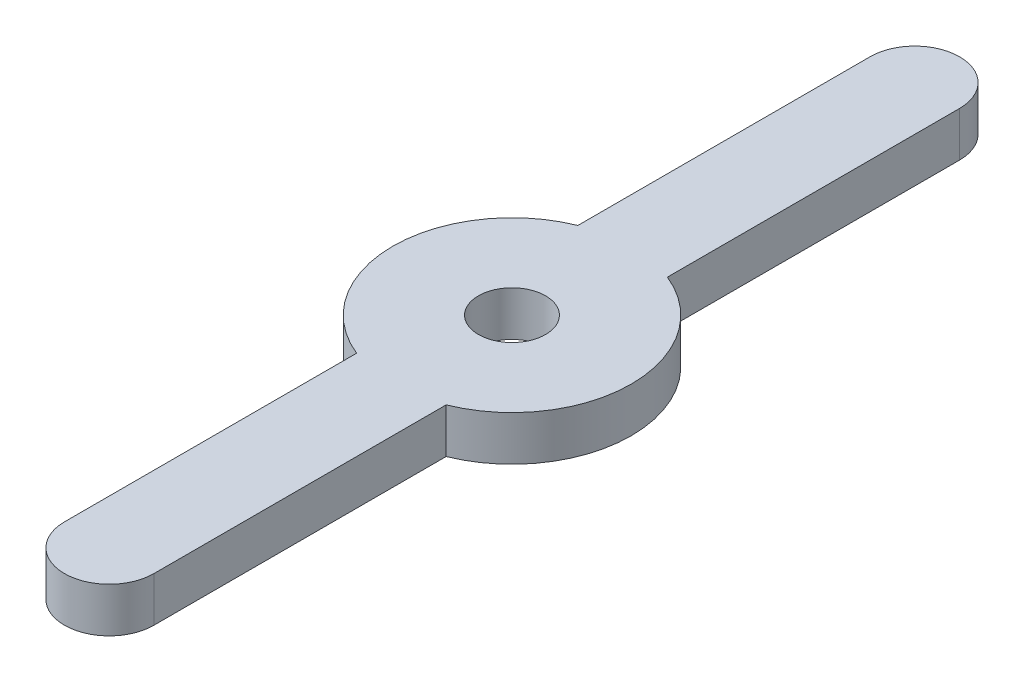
ISO-10303-21;
HEADER;
FILE_DESCRIPTION(('STEP AP214'),'2;1');
FILE_NAME('part.step','',(''),(''),'','','');
FILE_SCHEMA(('AUTOMOTIVE_DESIGN { 1 0 10303 214 1 1 1 1 }'));
ENDSEC;
DATA;
#1=APPLICATION_CONTEXT('core data for automotive mechanical design processes');
#2=APPLICATION_PROTOCOL_DEFINITION('international standard','automotive_design',2000,#1);
#3=PRODUCT_CONTEXT('',#1,'mechanical');
#4=PRODUCT('Part','Part','',(#3));
#5=PRODUCT_RELATED_PRODUCT_CATEGORY('part','',(#4));
#6=PRODUCT_DEFINITION_FORMATION('','',#4);
#7=PRODUCT_DEFINITION_CONTEXT('part definition',#1,'design');
#8=PRODUCT_DEFINITION('design','',#6,#7);
#9=PRODUCT_DEFINITION_SHAPE('','',#8);
#10=(LENGTH_UNIT() NAMED_UNIT(*) SI_UNIT(.MILLI.,.METRE.));
#11=(NAMED_UNIT(*) PLANE_ANGLE_UNIT() SI_UNIT($,.RADIAN.));
#12=(NAMED_UNIT(*) SI_UNIT($,.STERADIAN.) SOLID_ANGLE_UNIT());
#13=UNCERTAINTY_MEASURE_WITH_UNIT(LENGTH_MEASURE(1.E-05),#10,'distance_accuracy_value','');
#14=(GEOMETRIC_REPRESENTATION_CONTEXT(3) GLOBAL_UNCERTAINTY_ASSIGNED_CONTEXT((#13)) GLOBAL_UNIT_ASSIGNED_CONTEXT((#10,
#11,#12)) REPRESENTATION_CONTEXT('',''));
#15=CARTESIAN_POINT('',(0.,0.,0.));
#16=DIRECTION('',(0.,0.,1.));
#17=DIRECTION('',(1.,0.,0.));
#18=AXIS2_PLACEMENT_3D('',#15,#16,#17);
#19=CARTESIAN_POINT('',(0.,3.,-27.));
#20=DIRECTION('',(0.,1.,0.));
#21=DIRECTION('',(0.,0.,1.));
#22=AXIS2_PLACEMENT_3D('',#19,#20,#21);
#23=PLANE('',#22);
#24=CARTESIAN_POINT('',(0.,3.,-27.));
#25=DIRECTION('',(0.,1.,0.));
#26=DIRECTION('',(0.,0.,1.));
#27=AXIS2_PLACEMENT_3D('',#24,#25,#26);
#28=CIRCLE('',#27,8.);
#29=CARTESIAN_POINT('',(3.,3.,-19.5838015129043));
#30=VERTEX_POINT('',#29);
#31=CARTESIAN_POINT('',(3.,3.,-34.4161984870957));
#32=VERTEX_POINT('',#31);
#33=EDGE_CURVE('E143',#30,#32,#28,.T.);
#34=ORIENTED_EDGE('',*,*,#33,.T.);
#35=DIRECTION('',(0.,0.,-1.));
#36=VECTOR('',#35,1.);
#37=CARTESIAN_POINT('',(3.,3.,-54.));
#38=LINE('',#37,#36);
#39=CARTESIAN_POINT('',(3.,3.,-54.));
#40=VERTEX_POINT('',#39);
#41=EDGE_CURVE('E91',#32,#40,#38,.T.);
#42=ORIENTED_EDGE('',*,*,#41,.T.);
#43=CARTESIAN_POINT('',(0.,3.,-54.));
#44=DIRECTION('',(0.,1.,0.));
#45=DIRECTION('',(0.,0.,1.));
#46=AXIS2_PLACEMENT_3D('',#43,#44,#45);
#47=CIRCLE('',#46,3.);
#48=CARTESIAN_POINT('',(-3.,3.,-54.));
#49=VERTEX_POINT('',#48);
#50=EDGE_CURVE('E158',#40,#49,#47,.T.);
#51=ORIENTED_EDGE('',*,*,#50,.T.);
#52=DIRECTION('',(0.,0.,1.));
#53=VECTOR('',#52,1.);
#54=CARTESIAN_POINT('',(-3.,3.,-54.));
#55=LINE('',#54,#53);
#56=CARTESIAN_POINT('',(-3.,3.,-34.4161984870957));
#57=VERTEX_POINT('',#56);
#58=EDGE_CURVE('E171',#49,#57,#55,.T.);
#59=ORIENTED_EDGE('',*,*,#58,.T.);
#60=CARTESIAN_POINT('',(0.,3.,-27.));
#61=DIRECTION('',(0.,1.,0.));
#62=DIRECTION('',(0.,0.,1.));
#63=AXIS2_PLACEMENT_3D('',#60,#61,#62);
#64=CIRCLE('',#63,8.);
#65=CARTESIAN_POINT('',(-3.,3.,-19.5838015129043));
#66=VERTEX_POINT('',#65);
#67=EDGE_CURVE('E110',#57,#66,#64,.T.);
#68=ORIENTED_EDGE('',*,*,#67,.T.);
#69=DIRECTION('',(0.,0.,1.));
#70=VECTOR('',#69,1.);
#71=CARTESIAN_POINT('',(-3.,3.,-19.5838015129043));
#72=LINE('',#71,#70);
#73=CARTESIAN_POINT('',(-3.,3.,0.));
#74=VERTEX_POINT('',#73);
#75=EDGE_CURVE('E104',#66,#74,#72,.T.);
#76=ORIENTED_EDGE('',*,*,#75,.T.);
#77=CARTESIAN_POINT('',(0.,3.,0.));
#78=DIRECTION('',(0.,1.,0.));
#79=DIRECTION('',(0.,0.,1.));
#80=AXIS2_PLACEMENT_3D('',#77,#78,#79);
#81=CIRCLE('',#80,3.);
#82=CARTESIAN_POINT('',(3.,3.,0.));
#83=VERTEX_POINT('',#82);
#84=EDGE_CURVE('E108',#74,#83,#81,.T.);
#85=ORIENTED_EDGE('',*,*,#84,.T.);
#86=DIRECTION('',(0.,0.,-1.));
#87=VECTOR('',#86,1.);
#88=CARTESIAN_POINT('',(3.,3.,-19.5838015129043));
#89=LINE('',#88,#87);
#90=EDGE_CURVE('E48',#83,#30,#89,.T.);
#91=ORIENTED_EDGE('',*,*,#90,.T.);
#92=EDGE_LOOP('',(#34,#42,#51,#59,#68,#76,#85,#91));
#93=FACE_BOUND('',#92,.T.);
#94=CARTESIAN_POINT('',(0.,3.,-27.));
#95=DIRECTION('',(0.,1.,0.));
#96=DIRECTION('',(0.,0.,1.));
#97=AXIS2_PLACEMENT_3D('',#94,#95,#96);
#98=CIRCLE('',#97,2.25);
#99=CARTESIAN_POINT('',(0.,3.,-24.75));
#100=VERTEX_POINT('',#99);
#101=EDGE_CURVE('E132',#100,#100,#98,.T.);
#102=ORIENTED_EDGE('',*,*,#101,.F.);
#103=EDGE_LOOP('',(#102));
#104=FACE_BOUND('',#103,.T.);
#105=ADVANCED_FACE('F31',(#93,#104),#23,.T.);
#106=CARTESIAN_POINT('',(0.,0.,-27.));
#107=DIRECTION('',(0.,1.,0.));
#108=DIRECTION('',(0.,0.,1.));
#109=AXIS2_PLACEMENT_3D('',#106,#107,#108);
#110=PLANE('',#109);
#111=CARTESIAN_POINT('',(0.,0.,-27.));
#112=DIRECTION('',(0.,1.,0.));
#113=DIRECTION('',(0.,0.,1.));
#114=AXIS2_PLACEMENT_3D('',#111,#112,#113);
#115=CIRCLE('',#114,8.);
#116=CARTESIAN_POINT('',(3.,0.,-19.5838015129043));
#117=VERTEX_POINT('',#116);
#118=CARTESIAN_POINT('',(3.,0.,-34.4161984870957));
#119=VERTEX_POINT('',#118);
#120=EDGE_CURVE('E128',#117,#119,#115,.T.);
#121=ORIENTED_EDGE('',*,*,#120,.F.);
#122=DIRECTION('',(0.,0.,-1.));
#123=VECTOR('',#122,1.);
#124=CARTESIAN_POINT('',(3.,0.,-19.5838015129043));
#125=LINE('',#124,#123);
#126=CARTESIAN_POINT('',(3.,0.,0.));
#127=VERTEX_POINT('',#126);
#128=EDGE_CURVE('E83',#127,#117,#125,.T.);
#129=ORIENTED_EDGE('',*,*,#128,.F.);
#130=CARTESIAN_POINT('',(0.,0.,0.));
#131=DIRECTION('',(0.,1.,0.));
#132=DIRECTION('',(0.,0.,1.));
#133=AXIS2_PLACEMENT_3D('',#130,#131,#132);
#134=CIRCLE('',#133,3.);
#135=CARTESIAN_POINT('',(-3.,0.,0.));
#136=VERTEX_POINT('',#135);
#137=EDGE_CURVE('E77',#136,#127,#134,.T.);
#138=ORIENTED_EDGE('',*,*,#137,.F.);
#139=DIRECTION('',(0.,0.,1.));
#140=VECTOR('',#139,1.);
#141=CARTESIAN_POINT('',(-3.,0.,-19.5838015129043));
#142=LINE('',#141,#140);
#143=CARTESIAN_POINT('',(-3.,0.,-19.5838015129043));
#144=VERTEX_POINT('',#143);
#145=EDGE_CURVE('E118',#144,#136,#142,.T.);
#146=ORIENTED_EDGE('',*,*,#145,.F.);
#147=CARTESIAN_POINT('',(0.,0.,-27.));
#148=DIRECTION('',(0.,1.,0.));
#149=DIRECTION('',(0.,0.,1.));
#150=AXIS2_PLACEMENT_3D('',#147,#148,#149);
#151=CIRCLE('',#150,8.);
#152=CARTESIAN_POINT('',(-3.,0.,-34.4161984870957));
#153=VERTEX_POINT('',#152);
#154=EDGE_CURVE('E138',#153,#144,#151,.T.);
#155=ORIENTED_EDGE('',*,*,#154,.F.);
#156=DIRECTION('',(0.,0.,1.));
#157=VECTOR('',#156,1.);
#158=CARTESIAN_POINT('',(-3.,0.,-54.));
#159=LINE('',#158,#157);
#160=CARTESIAN_POINT('',(-3.,0.,-54.));
#161=VERTEX_POINT('',#160);
#162=EDGE_CURVE('E136',#161,#153,#159,.T.);
#163=ORIENTED_EDGE('',*,*,#162,.F.);
#164=CARTESIAN_POINT('',(0.,0.,-54.));
#165=DIRECTION('',(0.,1.,0.));
#166=DIRECTION('',(0.,0.,1.));
#167=AXIS2_PLACEMENT_3D('',#164,#165,#166);
#168=CIRCLE('',#167,3.);
#169=CARTESIAN_POINT('',(3.,0.,-54.));
#170=VERTEX_POINT('',#169);
#171=EDGE_CURVE('E134',#170,#161,#168,.T.);
#172=ORIENTED_EDGE('',*,*,#171,.F.);
#173=DIRECTION('',(0.,0.,-1.));
#174=VECTOR('',#173,1.);
#175=CARTESIAN_POINT('',(3.,0.,-54.));
#176=LINE('',#175,#174);
#177=EDGE_CURVE('E131',#119,#170,#176,.T.);
#178=ORIENTED_EDGE('',*,*,#177,.F.);
#179=EDGE_LOOP('',(#121,#129,#138,#146,#155,#163,#172,#178));
#180=FACE_BOUND('',#179,.T.);
#181=CARTESIAN_POINT('',(0.,0.,-27.));
#182=DIRECTION('',(0.,1.,0.));
#183=DIRECTION('',(0.,0.,1.));
#184=AXIS2_PLACEMENT_3D('',#181,#182,#183);
#185=CIRCLE('',#184,2.25);
#186=CARTESIAN_POINT('',(0.,0.,-24.75));
#187=VERTEX_POINT('',#186);
#188=EDGE_CURVE('E177',#187,#187,#185,.T.);
#189=ORIENTED_EDGE('',*,*,#188,.T.);
#190=EDGE_LOOP('',(#189));
#191=FACE_BOUND('',#190,.T.);
#192=ADVANCED_FACE('F162',(#180,#191),#110,.F.);
#193=CARTESIAN_POINT('',(0.,3.,-27.));
#194=DIRECTION('',(0.,-1.,0.));
#195=DIRECTION('',(0.,0.,-1.));
#196=AXIS2_PLACEMENT_3D('',#193,#194,#195);
#197=CYLINDRICAL_SURFACE('',#196,8.);
#198=ORIENTED_EDGE('',*,*,#120,.T.);
#199=DIRECTION('',(0.,-1.,0.));
#200=VECTOR('',#199,1.);
#201=CARTESIAN_POINT('',(3.,3.,-34.4161984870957));
#202=LINE('',#201,#200);
#203=EDGE_CURVE('E11',#32,#119,#202,.T.);
#204=ORIENTED_EDGE('',*,*,#203,.F.);
#205=ORIENTED_EDGE('',*,*,#33,.F.);
#206=DIRECTION('',(0.,-1.,0.));
#207=VECTOR('',#206,1.);
#208=CARTESIAN_POINT('',(3.,3.,-19.5838015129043));
#209=LINE('',#208,#207);
#210=EDGE_CURVE('E124',#30,#117,#209,.T.);
#211=ORIENTED_EDGE('',*,*,#210,.T.);
#212=EDGE_LOOP('',(#198,#204,#205,#211));
#213=FACE_BOUND('',#212,.T.);
#214=ADVANCED_FACE('F33',(#213),#197,.T.);
#215=CARTESIAN_POINT('',(3.,3.,-54.));
#216=DIRECTION('',(-1.,0.,0.));
#217=DIRECTION('',(0.,0.,1.));
#218=AXIS2_PLACEMENT_3D('',#215,#216,#217);
#219=PLANE('',#218);
#220=ORIENTED_EDGE('',*,*,#177,.T.);
#221=DIRECTION('',(0.,-1.,0.));
#222=VECTOR('',#221,1.);
#223=CARTESIAN_POINT('',(3.,3.,-54.));
#224=LINE('',#223,#222);
#225=EDGE_CURVE('E40',#40,#170,#224,.T.);
#226=ORIENTED_EDGE('',*,*,#225,.F.);
#227=ORIENTED_EDGE('',*,*,#41,.F.);
#228=ORIENTED_EDGE('',*,*,#203,.T.);
#229=EDGE_LOOP('',(#220,#226,#227,#228));
#230=FACE_BOUND('',#229,.T.);
#231=ADVANCED_FACE('F205',(#230),#219,.F.);
#232=CARTESIAN_POINT('',(0.,3.,-54.));
#233=DIRECTION('',(0.,-1.,0.));
#234=DIRECTION('',(0.,0.,-1.));
#235=AXIS2_PLACEMENT_3D('',#232,#233,#234);
#236=CYLINDRICAL_SURFACE('',#235,3.);
#237=ORIENTED_EDGE('',*,*,#171,.T.);
#238=DIRECTION('',(0.,-1.,0.));
#239=VECTOR('',#238,1.);
#240=CARTESIAN_POINT('',(-3.,3.,-54.));
#241=LINE('',#240,#239);
#242=EDGE_CURVE('E150',#49,#161,#241,.T.);
#243=ORIENTED_EDGE('',*,*,#242,.F.);
#244=ORIENTED_EDGE('',*,*,#50,.F.);
#245=ORIENTED_EDGE('',*,*,#225,.T.);
#246=EDGE_LOOP('',(#237,#243,#244,#245));
#247=FACE_BOUND('',#246,.T.);
#248=ADVANCED_FACE('F156',(#247),#236,.T.);
#249=CARTESIAN_POINT('',(-3.,3.,-54.));
#250=DIRECTION('',(1.,0.,0.));
#251=DIRECTION('',(0.,0.,-1.));
#252=AXIS2_PLACEMENT_3D('',#249,#250,#251);
#253=PLANE('',#252);
#254=ORIENTED_EDGE('',*,*,#162,.T.);
#255=DIRECTION('',(0.,-1.,0.));
#256=VECTOR('',#255,1.);
#257=CARTESIAN_POINT('',(-3.,3.,-34.4161984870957));
#258=LINE('',#257,#256);
#259=EDGE_CURVE('E147',#57,#153,#258,.T.);
#260=ORIENTED_EDGE('',*,*,#259,.F.);
#261=ORIENTED_EDGE('',*,*,#58,.F.);
#262=ORIENTED_EDGE('',*,*,#242,.T.);
#263=EDGE_LOOP('',(#254,#260,#261,#262));
#264=FACE_BOUND('',#263,.T.);
#265=ADVANCED_FACE('F167',(#264),#253,.F.);
#266=CARTESIAN_POINT('',(0.,3.,-27.));
#267=DIRECTION('',(0.,-1.,0.));
#268=DIRECTION('',(0.,0.,-1.));
#269=AXIS2_PLACEMENT_3D('',#266,#267,#268);
#270=CYLINDRICAL_SURFACE('',#269,8.);
#271=ORIENTED_EDGE('',*,*,#154,.T.);
#272=DIRECTION('',(0.,-1.,0.));
#273=VECTOR('',#272,1.);
#274=CARTESIAN_POINT('',(-3.,3.,-19.5838015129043));
#275=LINE('',#274,#273);
#276=EDGE_CURVE('E119',#66,#144,#275,.T.);
#277=ORIENTED_EDGE('',*,*,#276,.F.);
#278=ORIENTED_EDGE('',*,*,#67,.F.);
#279=ORIENTED_EDGE('',*,*,#259,.T.);
#280=EDGE_LOOP('',(#271,#277,#278,#279));
#281=FACE_BOUND('',#280,.T.);
#282=ADVANCED_FACE('F170',(#281),#270,.T.);
#283=CARTESIAN_POINT('',(-3.,3.,-19.5838015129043));
#284=DIRECTION('',(1.,0.,0.));
#285=DIRECTION('',(0.,0.,-1.));
#286=AXIS2_PLACEMENT_3D('',#283,#284,#285);
#287=PLANE('',#286);
#288=ORIENTED_EDGE('',*,*,#145,.T.);
#289=DIRECTION('',(0.,-1.,0.));
#290=VECTOR('',#289,1.);
#291=CARTESIAN_POINT('',(-3.,3.,0.));
#292=LINE('',#291,#290);
#293=EDGE_CURVE('E115',#74,#136,#292,.T.);
#294=ORIENTED_EDGE('',*,*,#293,.F.);
#295=ORIENTED_EDGE('',*,*,#75,.F.);
#296=ORIENTED_EDGE('',*,*,#276,.T.);
#297=EDGE_LOOP('',(#288,#294,#295,#296));
#298=FACE_BOUND('',#297,.T.);
#299=ADVANCED_FACE('F116',(#298),#287,.F.);
#300=CARTESIAN_POINT('',(0.,3.,0.));
#301=DIRECTION('',(0.,-1.,0.));
#302=DIRECTION('',(0.,0.,-1.));
#303=AXIS2_PLACEMENT_3D('',#300,#301,#302);
#304=CYLINDRICAL_SURFACE('',#303,3.);
#305=ORIENTED_EDGE('',*,*,#137,.T.);
#306=DIRECTION('',(0.,-1.,0.));
#307=VECTOR('',#306,1.);
#308=CARTESIAN_POINT('',(3.,3.,0.));
#309=LINE('',#308,#307);
#310=EDGE_CURVE('E120',#83,#127,#309,.T.);
#311=ORIENTED_EDGE('',*,*,#310,.F.);
#312=ORIENTED_EDGE('',*,*,#84,.F.);
#313=ORIENTED_EDGE('',*,*,#293,.T.);
#314=EDGE_LOOP('',(#305,#311,#312,#313));
#315=FACE_BOUND('',#314,.T.);
#316=ADVANCED_FACE('F122',(#315),#304,.T.);
#317=CARTESIAN_POINT('',(3.,3.,-19.5838015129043));
#318=DIRECTION('',(-1.,0.,0.));
#319=DIRECTION('',(0.,0.,1.));
#320=AXIS2_PLACEMENT_3D('',#317,#318,#319);
#321=PLANE('',#320);
#322=ORIENTED_EDGE('',*,*,#128,.T.);
#323=ORIENTED_EDGE('',*,*,#210,.F.);
#324=ORIENTED_EDGE('',*,*,#90,.F.);
#325=ORIENTED_EDGE('',*,*,#310,.T.);
#326=EDGE_LOOP('',(#322,#323,#324,#325));
#327=FACE_BOUND('',#326,.T.);
#328=ADVANCED_FACE('F193',(#327),#321,.F.);
#329=CARTESIAN_POINT('',(0.,3.,-27.));
#330=DIRECTION('',(0.,-1.,0.));
#331=DIRECTION('',(0.,0.,-1.));
#332=AXIS2_PLACEMENT_3D('',#329,#330,#331);
#333=CYLINDRICAL_SURFACE('',#332,2.25);
#334=ORIENTED_EDGE('',*,*,#101,.T.);
#335=EDGE_LOOP('',(#334));
#336=FACE_BOUND('',#335,.T.);
#337=ORIENTED_EDGE('',*,*,#188,.F.);
#338=EDGE_LOOP('',(#337));
#339=FACE_BOUND('',#338,.T.);
#340=ADVANCED_FACE('F183',(#336,#339),#333,.F.);
#341=CLOSED_SHELL('',(#105,#192,#214,#231,#248,#265,#282,#299,#316,#328,#340));
#342=MANIFOLD_SOLID_BREP('B2',#341);
#343=ADVANCED_BREP_SHAPE_REPRESENTATION('',(#18,#342),#14);
#344=SHAPE_DEFINITION_REPRESENTATION(#9,#343);
ENDSEC;
END-ISO-10303-21;
